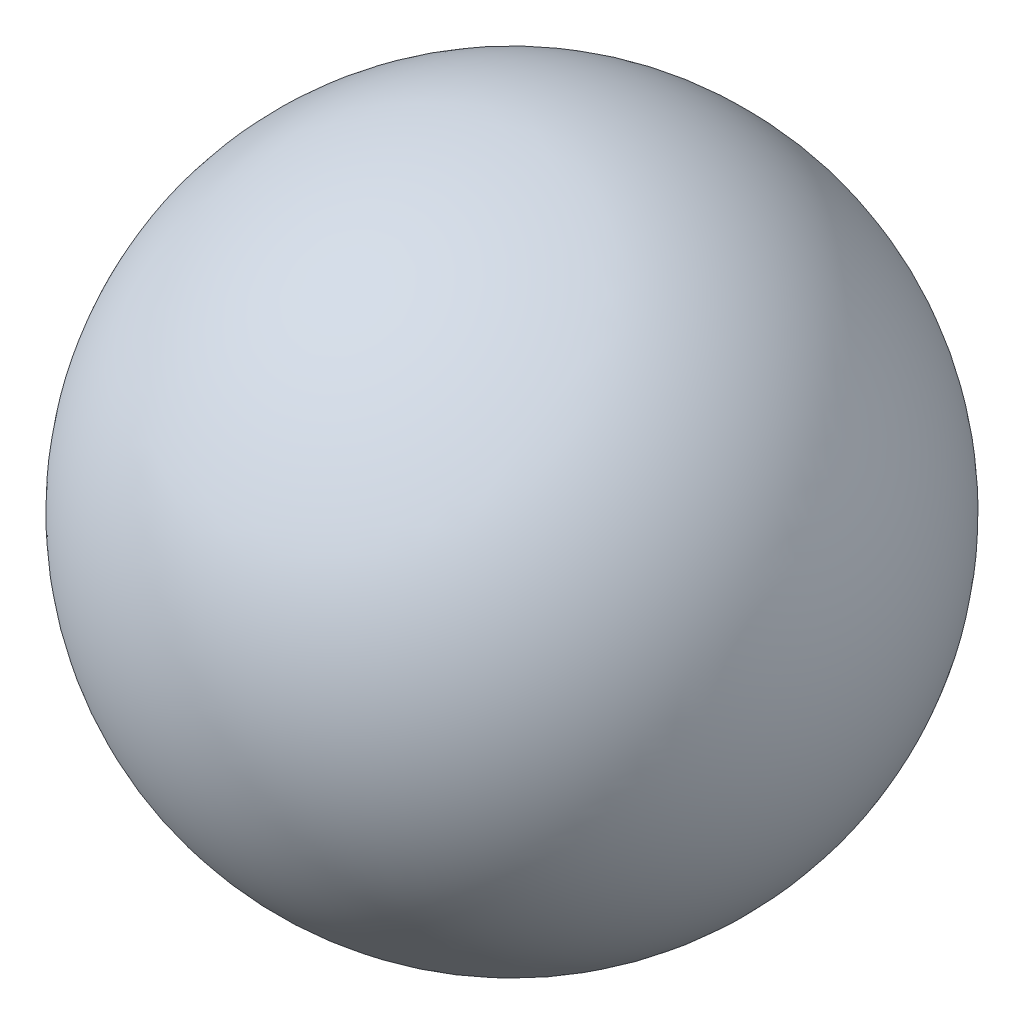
ISO-10303-21;
HEADER;
FILE_DESCRIPTION(('STEP AP214'),'2;1');
FILE_NAME('part.step','',(''),(''),'','','');
FILE_SCHEMA(('AUTOMOTIVE_DESIGN { 1 0 10303 214 1 1 1 1 }'));
ENDSEC;
DATA;
#1=APPLICATION_CONTEXT('core data for automotive mechanical design processes');
#2=APPLICATION_PROTOCOL_DEFINITION('international standard','automotive_design',2000,#1);
#3=PRODUCT_CONTEXT('',#1,'mechanical');
#4=PRODUCT('Part','Part','',(#3));
#5=PRODUCT_RELATED_PRODUCT_CATEGORY('part','',(#4));
#6=PRODUCT_DEFINITION_FORMATION('','',#4);
#7=PRODUCT_DEFINITION_CONTEXT('part definition',#1,'design');
#8=PRODUCT_DEFINITION('design','',#6,#7);
#9=PRODUCT_DEFINITION_SHAPE('','',#8);
#10=(LENGTH_UNIT() NAMED_UNIT(*) SI_UNIT(.MILLI.,.METRE.));
#11=(NAMED_UNIT(*) PLANE_ANGLE_UNIT() SI_UNIT($,.RADIAN.));
#12=(NAMED_UNIT(*) SI_UNIT($,.STERADIAN.) SOLID_ANGLE_UNIT());
#13=UNCERTAINTY_MEASURE_WITH_UNIT(LENGTH_MEASURE(1.E-05),#10,'distance_accuracy_value','');
#14=(GEOMETRIC_REPRESENTATION_CONTEXT(3) GLOBAL_UNCERTAINTY_ASSIGNED_CONTEXT((#13)) GLOBAL_UNIT_ASSIGNED_CONTEXT((#10,
#11,#12)) REPRESENTATION_CONTEXT('',''));
#15=CARTESIAN_POINT('',(0.,0.,0.));
#16=DIRECTION('',(0.,0.,1.));
#17=DIRECTION('',(1.,0.,0.));
#18=AXIS2_PLACEMENT_3D('',#15,#16,#17);
#19=CARTESIAN_POINT('',(0.,0.,0.));
#20=DIRECTION('',(-1.,0.,0.));
#21=DIRECTION('',(0.,-1.,0.));
#22=AXIS2_PLACEMENT_3D('',#19,#20,#21);
#23=SPHERICAL_SURFACE('',#22,3.95);
#24=CARTESIAN_POINT('',(-3.95,0.,0.));
#25=VERTEX_POINT('',#24);
#26=VERTEX_LOOP('',#25);
#27=FACE_BOUND('',#26,.T.);
#28=ADVANCED_FACE('F20',(#27),#23,.T.);
#29=CLOSED_SHELL('',(#28));
#30=MANIFOLD_SOLID_BREP('B2',#29);
#31=ADVANCED_BREP_SHAPE_REPRESENTATION('',(#18,#30),#14);
#32=SHAPE_DEFINITION_REPRESENTATION(#9,#31);
ENDSEC;
END-ISO-10303-21;
